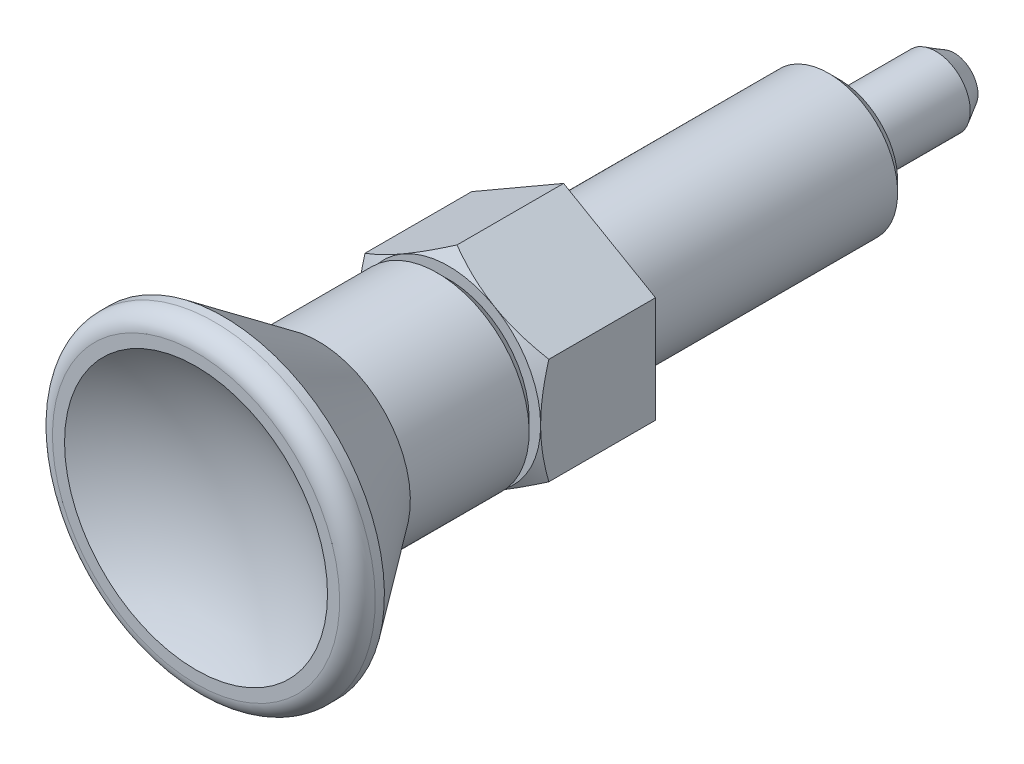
ISO-10303-21;
HEADER;
FILE_DESCRIPTION(('STEP AP214'),'2;1');
FILE_NAME('part.step','',(''),(''),'','','');
FILE_SCHEMA(('AUTOMOTIVE_DESIGN { 1 0 10303 214 1 1 1 1 }'));
ENDSEC;
DATA;
#1=APPLICATION_CONTEXT('core data for automotive mechanical design processes');
#2=APPLICATION_PROTOCOL_DEFINITION('international standard','automotive_design',2000,#1);
#3=PRODUCT_CONTEXT('',#1,'mechanical');
#4=PRODUCT('Part','Part','',(#3));
#5=PRODUCT_RELATED_PRODUCT_CATEGORY('part','',(#4));
#6=PRODUCT_DEFINITION_FORMATION('','',#4);
#7=PRODUCT_DEFINITION_CONTEXT('part definition',#1,'design');
#8=PRODUCT_DEFINITION('design','',#6,#7);
#9=PRODUCT_DEFINITION_SHAPE('','',#8);
#10=(LENGTH_UNIT() NAMED_UNIT(*) SI_UNIT(.MILLI.,.METRE.));
#11=(NAMED_UNIT(*) PLANE_ANGLE_UNIT() SI_UNIT($,.RADIAN.));
#12=(NAMED_UNIT(*) SI_UNIT($,.STERADIAN.) SOLID_ANGLE_UNIT());
#13=UNCERTAINTY_MEASURE_WITH_UNIT(LENGTH_MEASURE(1.E-05),#10,'distance_accuracy_value','');
#14=(GEOMETRIC_REPRESENTATION_CONTEXT(3) GLOBAL_UNCERTAINTY_ASSIGNED_CONTEXT((#13)) GLOBAL_UNIT_ASSIGNED_CONTEXT((#10,
#11,#12)) REPRESENTATION_CONTEXT('',''));
#15=CARTESIAN_POINT('',(0.,0.,0.));
#16=DIRECTION('',(0.,0.,1.));
#17=DIRECTION('',(1.,0.,0.));
#18=AXIS2_PLACEMENT_3D('',#15,#16,#17);
#19=CARTESIAN_POINT('',(0.,0.,3.2679491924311));
#20=DIRECTION('',(0.,0.,-1.));
#21=DIRECTION('',(1.,0.,0.));
#22=AXIS2_PLACEMENT_3D('',#19,#20,#21);
#23=CONICAL_SURFACE('',#22,7.,1.0471975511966);
#24=CARTESIAN_POINT('',(-4.,6.31761832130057,2.9922916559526));
#25=CARTESIAN_POINT('',(-4.,6.14192520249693,3.07797180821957));
#26=CARTESIAN_POINT('',(-4.,5.96584084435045,3.16286285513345));
#27=CARTESIAN_POINT('',(-4.,5.61268201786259,3.33062511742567));
#28=CARTESIAN_POINT('',(-4.,5.4356074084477,3.4134960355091));
#29=CARTESIAN_POINT('',(-4.,5.07940162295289,3.57716927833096));
#30=CARTESIAN_POINT('',(-4.,4.9002645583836,3.65795883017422));
#31=CARTESIAN_POINT('',(-4.,4.54060511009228,3.81638112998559));
#32=CARTESIAN_POINT('',(-4.,4.36008278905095,3.89401401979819));
#33=CARTESIAN_POINT('',(-4.,3.9911078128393,4.04790350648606));
#34=CARTESIAN_POINT('',(-4.,3.80259647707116,4.12402014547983));
#35=CARTESIAN_POINT('',(-4.,3.42341084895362,4.27076449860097));
#36=CARTESIAN_POINT('',(-4.,3.23273632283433,4.34139161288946));
#37=CARTESIAN_POINT('',(-4.,2.84924251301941,4.47538599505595));
#38=CARTESIAN_POINT('',(-4.,2.65642808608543,4.5387670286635));
#39=CARTESIAN_POINT('',(-4.,2.2680353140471,4.65631131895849));
#40=CARTESIAN_POINT('',(-4.,2.07245782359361,4.71047736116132));
#41=CARTESIAN_POINT('',(-4.,1.67954158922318,4.80677280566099));
#42=CARTESIAN_POINT('',(-4.,1.48222021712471,4.84897182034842));
#43=CARTESIAN_POINT('',(-4.,1.08500777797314,4.91903453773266));
#44=CARTESIAN_POINT('',(-4.,0.885116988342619,4.94689977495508));
#45=CARTESIAN_POINT('',(-4.,0.48641972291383,4.98571330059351));
#46=CARTESIAN_POINT('',(-4.,0.287635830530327,4.9968878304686));
#47=CARTESIAN_POINT('',(-4.,-0.110173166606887,5.00197590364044));
#48=CARTESIAN_POINT('',(-4.,-0.309198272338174,4.99588937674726));
#49=CARTESIAN_POINT('',(-4.,-0.643785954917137,4.97158820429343));
#50=CARTESIAN_POINT('',(-4.,-0.779690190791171,4.95777215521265));
#51=CARTESIAN_POINT('',(-4.,-1.05057142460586,4.92289191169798));
#52=CARTESIAN_POINT('',(-4.,-1.18554830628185,4.9018268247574));
#53=CARTESIAN_POINT('',(-4.,-1.58887088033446,4.8288581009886));
#54=CARTESIAN_POINT('',(-4.,-1.8554737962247,4.76719214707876));
#55=CARTESIAN_POINT('',(-4.,-2.2542740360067,4.65940087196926));
#56=CARTESIAN_POINT('',(-4.,-2.38851478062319,4.62039718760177));
#57=CARTESIAN_POINT('',(-4.,-2.65569482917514,4.53812259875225));
#58=CARTESIAN_POINT('',(-4.,-2.78863412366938,4.49485166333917));
#59=CARTESIAN_POINT('',(-4.,-3.05324930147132,4.40475468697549));
#60=CARTESIAN_POINT('',(-4.,-3.18492553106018,4.3579296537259));
#61=CARTESIAN_POINT('',(-4.,-3.44717271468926,4.26129676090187));
#62=CARTESIAN_POINT('',(-4.,-3.57774368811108,4.21148895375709));
#63=CARTESIAN_POINT('',(-4.,-3.90838583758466,4.08171887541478));
#64=CARTESIAN_POINT('',(-4.,-4.10778247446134,4.00004019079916));
#65=CARTESIAN_POINT('',(-4.,-4.50466534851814,3.83215118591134));
#66=CARTESIAN_POINT('',(-4.,-4.70215141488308,3.74594046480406));
#67=CARTESIAN_POINT('',(-4.,-5.09560571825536,3.56998451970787));
#68=CARTESIAN_POINT('',(-4.,-5.29157350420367,3.48023829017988));
#69=CARTESIAN_POINT('',(-4.,-5.68222178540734,3.29798176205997));
#70=CARTESIAN_POINT('',(-4.,-5.87690224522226,3.2054713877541));
#71=CARTESIAN_POINT('',(-4.,-6.45989965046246,2.92441834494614));
#72=CARTESIAN_POINT('',(-4.,-6.84663497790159,2.73259823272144));
#73=CARTESIAN_POINT('',(-4.,-7.61714397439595,2.34330251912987));
#74=CARTESIAN_POINT('',(-4.,-8.0009181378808,2.14582788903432));
#75=CARTESIAN_POINT('',(-4.,-8.72975807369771,1.76604091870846));
#76=CARTESIAN_POINT('',(-4.,-9.07501124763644,1.58408754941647));
#77=CARTESIAN_POINT('',(-4.,-9.76427122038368,1.21779786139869));
#78=CARTESIAN_POINT('',(-4.,-10.1082779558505,1.03346142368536));
#79=CARTESIAN_POINT('',(-4.,-10.7942722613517,0.663568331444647));
#80=CARTESIAN_POINT('',(-4.,-11.1362627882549,0.478017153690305));
#81=CARTESIAN_POINT('',(-4.,-11.8194584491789,0.105530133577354));
#82=CARTESIAN_POINT('',(-4.,-12.1606636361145,-0.0814056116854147));
#83=CARTESIAN_POINT('',(-4.,-12.5015869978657,-0.26885020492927));
#84=B_SPLINE_CURVE_WITH_KNOTS('',3,(#24,#25,#26,#27,#28,#29,#30,#31,#32,#33,#34,#35,#36,#37,#38,
#39,#40,#41,#42,#43,#44,#45,#46,#47,#48,#49,#50,#51,#52,#53,#54,#55,#56,#57,#58,#59,#60,#61,#62,
#63,#64,#65,#66,#67,#68,#69,#70,#71,#72,#73,#74,#75,#76,#77,#78,#79,#80,#81,#82,#83),
.UNSPECIFIED.,.F.,.F.,(4,2,2,2,2,2,2,2,2,2,2,2,2,2,2,2,2,2,2,2,2,2,2,2,2,2,2,2,2,4),(0.,
0.586421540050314,1.1729288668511,1.76244097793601,2.35192656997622,2.96175582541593,
3.5716516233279,4.18036881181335,4.78890166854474,5.39381845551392,5.99867046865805,
6.59524689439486,7.1918257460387,7.60144321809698,8.01111114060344,8.83085062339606,
9.25018861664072,9.66952964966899,10.0887522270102,10.5079674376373,11.1543192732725,
11.8007283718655,12.447322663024,13.0939346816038,14.3889300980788,15.6837043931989,
16.8544868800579,18.0253280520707,19.1925780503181,20.3597469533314),.UNSPECIFIED.);
#85=CARTESIAN_POINT('',(-4.,-2.3094010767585,4.64273441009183));
#86=VERTEX_POINT('',#85);
#87=CARTESIAN_POINT('',(-4.,0.,5.));
#88=VERTEX_POINT('',#87);
#89=EDGE_CURVE('E9',#86,#88,#84,.F.);
#90=ORIENTED_EDGE('',*,*,#89,.F.);
#91=CARTESIAN_POINT('',(0.000199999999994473,-4.61891762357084,4.64266774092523));
#92=CARTESIAN_POINT('',(-0.175579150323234,-4.5174314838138,4.70128212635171));
#93=CARTESIAN_POINT('',(-0.352875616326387,-4.41506932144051,4.75458967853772));
#94=CARTESIAN_POINT('',(-0.710538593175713,-4.20857250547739,4.84763832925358));
#95=CARTESIAN_POINT('',(-0.890911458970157,-4.10443418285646,4.88734651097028));
#96=CARTESIAN_POINT('',(-1.2494218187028,-3.89744813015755,4.94915778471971));
#97=CARTESIAN_POINT('',(-1.42750415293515,-3.79463224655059,4.97167226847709));
#98=CARTESIAN_POINT('',(-1.78450671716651,-3.58851671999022,4.99854937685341));
#99=CARTESIAN_POINT('',(-1.96342564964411,-3.48521782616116,5.00293425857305));
#100=CARTESIAN_POINT('',(-2.29774284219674,-3.29219970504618,4.99380992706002));
#101=CARTESIAN_POINT('',(-2.45319115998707,-3.20245157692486,4.98254104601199));
#102=CARTESIAN_POINT('',(-2.76307505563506,-3.02354002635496,4.94682600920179));
#103=CARTESIAN_POINT('',(-2.91750956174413,-2.93437722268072,4.92236765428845));
#104=CARTESIAN_POINT('',(-3.22803232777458,-2.75509682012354,4.86122393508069));
#105=CARTESIAN_POINT('',(-3.3840812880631,-2.66500191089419,4.82427939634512));
#106=CARTESIAN_POINT('',(-3.69385183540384,-2.486155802,4.74042992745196));
#107=CARTESIAN_POINT('',(-3.84757739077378,-2.39740231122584,4.69354469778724));
#108=CARTESIAN_POINT('',(-4.0002,-2.30928560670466,4.64266774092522));
#109=B_SPLINE_CURVE_WITH_KNOTS('',3,(#91,#92,#93,#94,#95,#96,#97,#98,#99,#100,#101,#102,#103,
#104,#105,#106,#107,#108),.UNSPECIFIED.,.F.,.F.,(4,2,2,2,2,2,2,2,4),(0.,0.634047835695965,
1.26961969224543,1.88946157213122,2.50854226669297,3.04757825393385,3.58711366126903,
4.13861653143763,4.68903648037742),.UNSPECIFIED.);
#110=CARTESIAN_POINT('',(-2.,-3.46410161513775,5.));
#111=VERTEX_POINT('',#110);
#112=EDGE_CURVE('E203',#111,#86,#109,.T.);
#113=ORIENTED_EDGE('',*,*,#112,.F.);
#114=CARTESIAN_POINT('',(0.,0.,5.));
#115=DIRECTION('',(0.,0.,1.));
#116=DIRECTION('',(-1.,0.,0.));
#117=AXIS2_PLACEMENT_3D('',#114,#115,#116);
#118=CIRCLE('',#117,4.);
#119=EDGE_CURVE('E124',#88,#111,#118,.T.);
#120=ORIENTED_EDGE('',*,*,#119,.F.);
#121=EDGE_LOOP('',(#90,#113,#120));
#122=FACE_BOUND('',#121,.T.);
#123=ADVANCED_FACE('F14',(#122),#23,.T.);
#124=CARTESIAN_POINT('',(-4.,2.3094010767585,4.64273441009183));
#125=VERTEX_POINT('',#124);
#126=EDGE_CURVE('E18',#88,#125,#84,.F.);
#127=ORIENTED_EDGE('',*,*,#126,.F.);
#128=CARTESIAN_POINT('',(-2.,3.46410161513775,5.));
#129=VERTEX_POINT('',#128);
#130=EDGE_CURVE('E116',#129,#88,#118,.T.);
#131=ORIENTED_EDGE('',*,*,#130,.F.);
#132=CARTESIAN_POINT('',(-4.0002,2.30928560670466,4.64266774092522));
#133=CARTESIAN_POINT('',(-3.82442084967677,2.4107717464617,4.7012821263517));
#134=CARTESIAN_POINT('',(-3.64712438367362,2.51313390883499,4.75458967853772));
#135=CARTESIAN_POINT('',(-3.28946140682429,2.71963072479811,4.84763832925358));
#136=CARTESIAN_POINT('',(-3.10908854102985,2.82376904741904,4.88734651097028));
#137=CARTESIAN_POINT('',(-2.75057818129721,3.03075510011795,4.9491577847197));
#138=CARTESIAN_POINT('',(-2.57249584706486,3.13357098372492,4.97167226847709));
#139=CARTESIAN_POINT('',(-2.21549328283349,3.33968651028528,4.99854937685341));
#140=CARTESIAN_POINT('',(-2.0365743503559,3.44298540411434,5.00293425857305));
#141=CARTESIAN_POINT('',(-1.70225715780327,3.63600352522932,4.99380992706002));
#142=CARTESIAN_POINT('',(-1.54680884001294,3.72575165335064,4.98254104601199));
#143=CARTESIAN_POINT('',(-1.23692494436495,3.90466320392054,4.94682600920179));
#144=CARTESIAN_POINT('',(-1.08249043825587,3.99382600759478,4.92236765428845));
#145=CARTESIAN_POINT('',(-0.771967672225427,4.17310641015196,4.8612239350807));
#146=CARTESIAN_POINT('',(-0.615918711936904,4.2632013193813,4.82427939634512));
#147=CARTESIAN_POINT('',(-0.306148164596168,4.4420474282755,4.74042992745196));
#148=CARTESIAN_POINT('',(-0.152422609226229,4.53080091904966,4.69354469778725));
#149=CARTESIAN_POINT('',(0.00019999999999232,4.61891762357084,4.64266774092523));
#150=B_SPLINE_CURVE_WITH_KNOTS('',3,(#132,#133,#134,#135,#136,#137,#138,#139,#140,#141,#142,
#143,#144,#145,#146,#147,#148,#149),.UNSPECIFIED.,.F.,.F.,(4,2,2,2,2,2,2,2,4),(0.,
0.634047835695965,1.26961969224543,1.88946157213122,2.50854226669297,3.04757825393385,
3.58711366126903,4.13861653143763,4.68903648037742),.UNSPECIFIED.);
#151=EDGE_CURVE('E262',#125,#129,#150,.T.);
#152=ORIENTED_EDGE('',*,*,#151,.F.);
#153=EDGE_LOOP('',(#127,#131,#152));
#154=FACE_BOUND('',#153,.T.);
#155=ADVANCED_FACE('F225',(#154),#23,.T.);
#156=CARTESIAN_POINT('',(0.,4.618802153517,4.64273441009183));
#157=VERTEX_POINT('',#156);
#158=EDGE_CURVE('E112',#129,#157,#150,.T.);
#159=ORIENTED_EDGE('',*,*,#158,.F.);
#160=CARTESIAN_POINT('',(2.,3.46410161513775,5.));
#161=VERTEX_POINT('',#160);
#162=EDGE_CURVE('E110',#161,#129,#118,.T.);
#163=ORIENTED_EDGE('',*,*,#162,.F.);
#164=CARTESIAN_POINT('',(-0.000200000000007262,4.61891762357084,4.64266774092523));
#165=CARTESIAN_POINT('',(0.175579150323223,4.5174314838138,4.7012821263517));
#166=CARTESIAN_POINT('',(0.352875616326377,4.41506932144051,4.75458967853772));
#167=CARTESIAN_POINT('',(0.710538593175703,4.20857250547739,4.84763832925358));
#168=CARTESIAN_POINT('',(0.890911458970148,4.10443418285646,4.88734651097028));
#169=CARTESIAN_POINT('',(1.24942181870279,3.89744813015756,4.9491577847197));
#170=CARTESIAN_POINT('',(1.42750415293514,3.79463224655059,4.97167226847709));
#171=CARTESIAN_POINT('',(1.78450671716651,3.58851671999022,4.99854937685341));
#172=CARTESIAN_POINT('',(1.9634256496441,3.48521782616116,5.00293425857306));
#173=CARTESIAN_POINT('',(2.29774284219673,3.29219970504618,4.99380992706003));
#174=CARTESIAN_POINT('',(2.45319115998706,3.20245157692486,4.982541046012));
#175=CARTESIAN_POINT('',(2.76307505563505,3.02354002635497,4.94682600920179));
#176=CARTESIAN_POINT('',(2.91750956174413,2.93437722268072,4.92236765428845));
#177=CARTESIAN_POINT('',(3.22803232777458,2.75509682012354,4.8612239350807));
#178=CARTESIAN_POINT('',(3.3840812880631,2.6650019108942,4.82427939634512));
#179=CARTESIAN_POINT('',(3.69385183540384,2.486155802,4.74042992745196));
#180=CARTESIAN_POINT('',(3.84757739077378,2.39740231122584,4.69354469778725));
#181=CARTESIAN_POINT('',(4.0002,2.30928560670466,4.64266774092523));
#182=B_SPLINE_CURVE_WITH_KNOTS('',3,(#164,#165,#166,#167,#168,#169,#170,#171,#172,#173,#174,
#175,#176,#177,#178,#179,#180,#181),.UNSPECIFIED.,.F.,.F.,(4,2,2,2,2,2,2,2,4),(0.,
0.634047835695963,1.26961969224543,1.88946157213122,2.50854226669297,3.04757825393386,
3.58711366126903,4.13861653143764,4.68903648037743),.UNSPECIFIED.);
#183=EDGE_CURVE('E90',#157,#161,#182,.T.);
#184=ORIENTED_EDGE('',*,*,#183,.F.);
#185=EDGE_LOOP('',(#159,#163,#184));
#186=FACE_BOUND('',#185,.T.);
#187=ADVANCED_FACE('F111',(#186),#23,.T.);
#188=CARTESIAN_POINT('',(0.,-4.618802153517,4.64273441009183));
#189=VERTEX_POINT('',#188);
#190=EDGE_CURVE('E198',#189,#111,#109,.T.);
#191=ORIENTED_EDGE('',*,*,#190,.F.);
#192=CARTESIAN_POINT('',(4.0002,-2.30928560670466,4.64266774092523));
#193=CARTESIAN_POINT('',(3.82442084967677,-2.4107717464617,4.70128212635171));
#194=CARTESIAN_POINT('',(3.64712438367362,-2.51313390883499,4.75458967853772));
#195=CARTESIAN_POINT('',(3.28946140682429,-2.71963072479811,4.84763832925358));
#196=CARTESIAN_POINT('',(3.10908854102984,-2.82376904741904,4.88734651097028));
#197=CARTESIAN_POINT('',(2.75057818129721,-3.03075510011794,4.94915778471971));
#198=CARTESIAN_POINT('',(2.57249584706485,-3.13357098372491,4.97167226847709));
#199=CARTESIAN_POINT('',(2.21549328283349,-3.33968651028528,4.99854937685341));
#200=CARTESIAN_POINT('',(2.03657435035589,-3.44298540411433,5.00293425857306));
#201=CARTESIAN_POINT('',(1.70225715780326,-3.63600352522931,4.99380992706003));
#202=CARTESIAN_POINT('',(1.54680884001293,-3.72575165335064,4.982541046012));
#203=CARTESIAN_POINT('',(1.23692494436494,-3.90466320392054,4.94682600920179));
#204=CARTESIAN_POINT('',(1.08249043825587,-3.99382600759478,4.92236765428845));
#205=CARTESIAN_POINT('',(0.771967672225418,-4.17310641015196,4.8612239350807));
#206=CARTESIAN_POINT('',(0.615918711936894,-4.2632013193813,4.82427939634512));
#207=CARTESIAN_POINT('',(0.306148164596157,-4.4420474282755,4.74042992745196));
#208=CARTESIAN_POINT('',(0.152422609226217,-4.53080091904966,4.69354469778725));
#209=CARTESIAN_POINT('',(-0.000200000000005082,-4.61891762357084,4.64266774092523));
#210=B_SPLINE_CURVE_WITH_KNOTS('',3,(#192,#193,#194,#195,#196,#197,#198,#199,#200,#201,#202,
#203,#204,#205,#206,#207,#208,#209),.UNSPECIFIED.,.F.,.F.,(4,2,2,2,2,2,2,2,4),(0.,
0.634047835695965,1.26961969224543,1.88946157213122,2.50854226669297,3.04757825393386,
3.58711366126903,4.13861653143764,4.68903648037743),.UNSPECIFIED.);
#211=CARTESIAN_POINT('',(2.,-3.46410161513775,5.));
#212=VERTEX_POINT('',#211);
#213=EDGE_CURVE('E100',#212,#189,#210,.T.);
#214=ORIENTED_EDGE('',*,*,#213,.F.);
#215=EDGE_CURVE('E123',#111,#212,#118,.T.);
#216=ORIENTED_EDGE('',*,*,#215,.F.);
#217=EDGE_LOOP('',(#191,#214,#216));
#218=FACE_BOUND('',#217,.T.);
#219=ADVANCED_FACE('F243',(#218),#23,.T.);
#220=CARTESIAN_POINT('',(4.,2.3094010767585,4.64273441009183));
#221=VERTEX_POINT('',#220);
#222=EDGE_CURVE('E94',#161,#221,#182,.T.);
#223=ORIENTED_EDGE('',*,*,#222,.F.);
#224=CARTESIAN_POINT('',(4.,0.,5.));
#225=VERTEX_POINT('',#224);
#226=EDGE_CURVE('E106',#225,#161,#118,.T.);
#227=ORIENTED_EDGE('',*,*,#226,.F.);
#228=CARTESIAN_POINT('',(4.,6.31761832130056,2.9922916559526));
#229=CARTESIAN_POINT('',(4.,6.14192520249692,3.07797180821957));
#230=CARTESIAN_POINT('',(4.,5.96584084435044,3.16286285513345));
#231=CARTESIAN_POINT('',(4.,5.61268201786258,3.33062511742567));
#232=CARTESIAN_POINT('',(4.,5.4356074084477,3.4134960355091));
#233=CARTESIAN_POINT('',(4.,5.07940162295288,3.57716927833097));
#234=CARTESIAN_POINT('',(4.,4.9002645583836,3.65795883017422));
#235=CARTESIAN_POINT('',(4.,4.54060511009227,3.81638112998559));
#236=CARTESIAN_POINT('',(4.,4.36008278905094,3.89401401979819));
#237=CARTESIAN_POINT('',(4.,3.99110781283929,4.04790350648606));
#238=CARTESIAN_POINT('',(4.,3.80259647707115,4.12402014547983));
#239=CARTESIAN_POINT('',(4.,3.42341084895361,4.27076449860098));
#240=CARTESIAN_POINT('',(4.,3.23273632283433,4.34139161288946));
#241=CARTESIAN_POINT('',(4.,2.84924251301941,4.47538599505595));
#242=CARTESIAN_POINT('',(4.,2.65642808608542,4.5387670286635));
#243=CARTESIAN_POINT('',(4.,2.2680353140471,4.65631131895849));
#244=CARTESIAN_POINT('',(4.,2.07245782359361,4.71047736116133));
#245=CARTESIAN_POINT('',(4.,1.67954158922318,4.806772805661));
#246=CARTESIAN_POINT('',(4.,1.48222021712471,4.84897182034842));
#247=CARTESIAN_POINT('',(4.,1.08500777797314,4.91903453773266));
#248=CARTESIAN_POINT('',(4.,0.885116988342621,4.94689977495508));
#249=CARTESIAN_POINT('',(4.,0.486419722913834,4.98571330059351));
#250=CARTESIAN_POINT('',(4.,0.287635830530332,4.9968878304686));
#251=CARTESIAN_POINT('',(4.,-0.110173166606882,5.00197590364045));
#252=CARTESIAN_POINT('',(4.,-0.309198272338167,4.99588937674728));
#253=CARTESIAN_POINT('',(4.,-0.643785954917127,4.97158820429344));
#254=CARTESIAN_POINT('',(4.,-0.779690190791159,4.95777215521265));
#255=CARTESIAN_POINT('',(4.,-1.05057142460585,4.92289191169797));
#256=CARTESIAN_POINT('',(4.,-1.18554830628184,4.9018268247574));
#257=CARTESIAN_POINT('',(4.,-1.58887088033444,4.8288581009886));
#258=CARTESIAN_POINT('',(4.,-1.85547379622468,4.76719214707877));
#259=CARTESIAN_POINT('',(4.,-2.25427403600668,4.65940087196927));
#260=CARTESIAN_POINT('',(4.,-2.38851478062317,4.62039718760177));
#261=CARTESIAN_POINT('',(4.,-2.65569482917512,4.53812259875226));
#262=CARTESIAN_POINT('',(4.,-2.78863412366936,4.49485166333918));
#263=CARTESIAN_POINT('',(4.,-3.0532493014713,4.4047546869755));
#264=CARTESIAN_POINT('',(4.,-3.18492553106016,4.3579296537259));
#265=CARTESIAN_POINT('',(4.,-3.44717271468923,4.26129676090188));
#266=CARTESIAN_POINT('',(4.,-3.57774368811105,4.2114889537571));
#267=CARTESIAN_POINT('',(4.,-3.90838583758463,4.0817188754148));
#268=CARTESIAN_POINT('',(4.,-4.10778247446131,4.00004019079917));
#269=CARTESIAN_POINT('',(4.,-4.50466534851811,3.83215118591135));
#270=CARTESIAN_POINT('',(4.,-4.70215141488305,3.74594046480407));
#271=CARTESIAN_POINT('',(4.,-5.09560571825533,3.56998451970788));
#272=CARTESIAN_POINT('',(4.,-5.29157350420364,3.48023829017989));
#273=CARTESIAN_POINT('',(4.,-5.68222178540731,3.29798176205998));
#274=CARTESIAN_POINT('',(4.,-5.87690224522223,3.20547138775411));
#275=CARTESIAN_POINT('',(4.,-6.45989965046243,2.92441834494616));
#276=CARTESIAN_POINT('',(4.,-6.84663497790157,2.73259823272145));
#277=CARTESIAN_POINT('',(4.,-7.61714397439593,2.34330251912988));
#278=CARTESIAN_POINT('',(4.,-8.00091813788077,2.14582788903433));
#279=CARTESIAN_POINT('',(4.,-8.72975807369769,1.76604091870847));
#280=CARTESIAN_POINT('',(4.,-9.07501124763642,1.58408754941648));
#281=CARTESIAN_POINT('',(4.,-9.76427122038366,1.2177978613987));
#282=CARTESIAN_POINT('',(4.,-10.1082779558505,1.03346142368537));
#283=CARTESIAN_POINT('',(4.,-10.7942722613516,0.663568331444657));
#284=CARTESIAN_POINT('',(4.,-11.1362627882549,0.478017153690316));
#285=CARTESIAN_POINT('',(4.,-11.8194584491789,0.105530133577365));
#286=CARTESIAN_POINT('',(4.,-12.1606636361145,-0.0814056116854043));
#287=CARTESIAN_POINT('',(4.,-12.5015869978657,-0.268850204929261));
#288=B_SPLINE_CURVE_WITH_KNOTS('',3,(#228,#229,#230,#231,#232,#233,#234,#235,#236,#237,#238,
#239,#240,#241,#242,#243,#244,#245,#246,#247,#248,#249,#250,#251,#252,#253,#254,#255,#256,#257,
#258,#259,#260,#261,#262,#263,#264,#265,#266,#267,#268,#269,#270,#271,#272,#273,#274,#275,#276,
#277,#278,#279,#280,#281,#282,#283,#284,#285,#286,#287),.UNSPECIFIED.,.F.,.F.,(4,2,2,2,2,2,2,2,
2,2,2,2,2,2,2,2,2,2,2,2,2,2,2,2,2,2,2,2,2,4),(0.,0.586421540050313,1.1729288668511,
1.762440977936,2.35192656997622,2.96175582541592,3.57165162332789,4.18036881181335,
4.78890166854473,5.39381845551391,5.99867046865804,6.59524689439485,7.19182574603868,
7.60144321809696,8.01111114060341,8.83085062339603,9.25018861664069,9.66952964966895,
10.0887522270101,10.5079674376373,11.1543192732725,11.8007283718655,12.4473226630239,
13.0939346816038,14.3889300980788,15.6837043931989,16.8544868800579,18.0253280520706,
19.1925780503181,20.3597469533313),.UNSPECIFIED.);
#289=EDGE_CURVE('E41',#221,#225,#288,.T.);
#290=ORIENTED_EDGE('',*,*,#289,.F.);
#291=EDGE_LOOP('',(#223,#227,#290));
#292=FACE_BOUND('',#291,.T.);
#293=ADVANCED_FACE('F104',(#292),#23,.T.);
#294=CARTESIAN_POINT('',(4.,-2.3094010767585,4.64273441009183));
#295=VERTEX_POINT('',#294);
#296=EDGE_CURVE('E108',#295,#212,#210,.T.);
#297=ORIENTED_EDGE('',*,*,#296,.F.);
#298=EDGE_CURVE('E168',#225,#295,#288,.T.);
#299=ORIENTED_EDGE('',*,*,#298,.F.);
#300=EDGE_CURVE('E122',#212,#225,#118,.T.);
#301=ORIENTED_EDGE('',*,*,#300,.F.);
#302=EDGE_LOOP('',(#297,#299,#301));
#303=FACE_BOUND('',#302,.T.);
#304=ADVANCED_FACE('F227',(#303),#23,.T.);
#305=CARTESIAN_POINT('',(2.35599040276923E-13,0.,24.1999999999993));
#306=DIRECTION('',(0.,0.,1.));
#307=DIRECTION('',(-1.,0.,0.));
#308=AXIS2_PLACEMENT_3D('',#305,#306,#307);
#309=SPHERICAL_SURFACE('',#308,9.99999999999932);
#310=CARTESIAN_POINT('',(0.,0.,16.));
#311=DIRECTION('',(0.,0.,1.));
#312=DIRECTION('',(0.,-1.,0.));
#313=AXIS2_PLACEMENT_3D('',#310,#311,#312);
#314=CIRCLE('',#313,5.7236352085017);
#315=CARTESIAN_POINT('',(0.,-5.7236352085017,16.));
#316=VERTEX_POINT('',#315);
#317=EDGE_CURVE('E165',#316,#316,#314,.T.);
#318=ORIENTED_EDGE('',*,*,#317,.T.);
#319=EDGE_LOOP('',(#318));
#320=FACE_BOUND('',#319,.T.);
#321=ADVANCED_FACE('F16',(#320),#309,.F.);
#322=CARTESIAN_POINT('',(5.7236352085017,0.,16.));
#323=DIRECTION('',(0.,0.,1.));
#324=DIRECTION('',(0.,-1.,0.));
#325=AXIS2_PLACEMENT_3D('',#322,#323,#324);
#326=PLANE('',#325);
#327=CARTESIAN_POINT('',(0.,0.,16.));
#328=DIRECTION('',(0.,0.,1.));
#329=DIRECTION('',(0.,-1.,0.));
#330=AXIS2_PLACEMENT_3D('',#327,#328,#329);
#331=CIRCLE('',#330,6.25);
#332=CARTESIAN_POINT('',(0.,-6.25,16.));
#333=VERTEX_POINT('',#332);
#334=EDGE_CURVE('E162',#333,#333,#331,.T.);
#335=ORIENTED_EDGE('',*,*,#334,.T.);
#336=EDGE_LOOP('',(#335));
#337=FACE_BOUND('',#336,.T.);
#338=ORIENTED_EDGE('',*,*,#317,.F.);
#339=EDGE_LOOP('',(#338));
#340=FACE_BOUND('',#339,.T.);
#341=ADVANCED_FACE('F241',(#337,#340),#326,.T.);
#342=CARTESIAN_POINT('',(0.,0.,15.2015639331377));
#343=DIRECTION('',(0.,0.,1.));
#344=DIRECTION('',(0.,-1.,0.));
#345=AXIS2_PLACEMENT_3D('',#342,#343,#344);
#346=TOROIDAL_SURFACE('',#345,6.20000152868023,0.800000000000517);
#347=CARTESIAN_POINT('',(0.,0.,15.2));
#348=DIRECTION('',(0.,0.,1.));
#349=DIRECTION('',(0.,-1.,0.));
#350=AXIS2_PLACEMENT_3D('',#347,#348,#349);
#351=CIRCLE('',#350,7.);
#352=CARTESIAN_POINT('',(0.,-7.,15.2));
#353=VERTEX_POINT('',#352);
#354=EDGE_CURVE('E159',#353,#353,#351,.T.);
#355=ORIENTED_EDGE('',*,*,#354,.T.);
#356=EDGE_LOOP('',(#355));
#357=FACE_BOUND('',#356,.T.);
#358=ORIENTED_EDGE('',*,*,#334,.F.);
#359=EDGE_LOOP('',(#358));
#360=FACE_BOUND('',#359,.T.);
#361=ADVANCED_FACE('F335',(#357,#360),#346,.T.);
#362=CARTESIAN_POINT('',(0.,0.,-17.));
#363=DIRECTION('',(0.,0.,1.));
#364=DIRECTION('',(0.,-1.,0.));
#365=AXIS2_PLACEMENT_3D('',#362,#363,#364);
#366=CYLINDRICAL_SURFACE('',#365,7.);
#367=CARTESIAN_POINT('',(0.,0.,14.8));
#368=DIRECTION('',(0.,0.,1.));
#369=DIRECTION('',(0.,-1.,0.));
#370=AXIS2_PLACEMENT_3D('',#367,#368,#369);
#371=CIRCLE('',#370,7.);
#372=CARTESIAN_POINT('',(0.,-7.,14.8));
#373=VERTEX_POINT('',#372);
#374=EDGE_CURVE('E156',#373,#373,#371,.T.);
#375=ORIENTED_EDGE('',*,*,#374,.T.);
#376=EDGE_LOOP('',(#375));
#377=FACE_BOUND('',#376,.T.);
#378=ORIENTED_EDGE('',*,*,#354,.F.);
#379=EDGE_LOOP('',(#378));
#380=FACE_BOUND('',#379,.T.);
#381=ADVANCED_FACE('F331',(#377,#380),#366,.T.);
#382=CARTESIAN_POINT('',(0.,0.,14.8));
#383=DIRECTION('',(0.,0.,1.));
#384=DIRECTION('',(0.,-1.,0.));
#385=AXIS2_PLACEMENT_3D('',#382,#383,#384);
#386=CONICAL_SURFACE('',#385,7.,0.628318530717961);
#387=CARTESIAN_POINT('',(0.,0.,10.6708542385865));
#388=DIRECTION('',(0.,0.,1.));
#389=DIRECTION('',(0.,-1.,0.));
#390=AXIS2_PLACEMENT_3D('',#387,#388,#389);
#391=CIRCLE('',#390,4.);
#392=CARTESIAN_POINT('',(0.,-4.,10.6708542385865));
#393=VERTEX_POINT('',#392);
#394=EDGE_CURVE('E153',#393,#393,#391,.T.);
#395=ORIENTED_EDGE('',*,*,#394,.T.);
#396=EDGE_LOOP('',(#395));
#397=FACE_BOUND('',#396,.T.);
#398=ORIENTED_EDGE('',*,*,#374,.F.);
#399=EDGE_LOOP('',(#398));
#400=FACE_BOUND('',#399,.T.);
#401=ADVANCED_FACE('F327',(#397,#400),#386,.T.);
#402=CARTESIAN_POINT('',(0.,0.,-17.));
#403=DIRECTION('',(0.,0.,1.));
#404=DIRECTION('',(0.,-1.,0.));
#405=AXIS2_PLACEMENT_3D('',#402,#403,#404);
#406=CYLINDRICAL_SURFACE('',#405,4.);
#407=CARTESIAN_POINT('',(0.,0.,5.5));
#408=DIRECTION('',(0.,0.,1.));
#409=DIRECTION('',(0.,-1.,0.));
#410=AXIS2_PLACEMENT_3D('',#407,#408,#409);
#411=CIRCLE('',#410,4.);
#412=CARTESIAN_POINT('',(0.,-4.,5.5));
#413=VERTEX_POINT('',#412);
#414=EDGE_CURVE('E150',#413,#413,#411,.T.);
#415=ORIENTED_EDGE('',*,*,#414,.T.);
#416=EDGE_LOOP('',(#415));
#417=FACE_BOUND('',#416,.T.);
#418=ORIENTED_EDGE('',*,*,#394,.F.);
#419=EDGE_LOOP('',(#418));
#420=FACE_BOUND('',#419,.T.);
#421=ADVANCED_FACE('F323',(#417,#420),#406,.T.);
#422=CARTESIAN_POINT('',(0.,0.,5.5));
#423=DIRECTION('',(0.,0.,1.));
#424=DIRECTION('',(0.,-1.,0.));
#425=AXIS2_PLACEMENT_3D('',#422,#423,#424);
#426=CONICAL_SURFACE('',#425,4.,0.785398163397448);
#427=CARTESIAN_POINT('',(0.,0.,5.));
#428=DIRECTION('',(0.,0.,1.));
#429=DIRECTION('',(0.,-1.,0.));
#430=AXIS2_PLACEMENT_3D('',#427,#428,#429);
#431=CIRCLE('',#430,3.5);
#432=CARTESIAN_POINT('',(0.,-3.5,5.));
#433=VERTEX_POINT('',#432);
#434=EDGE_CURVE('E147',#433,#433,#431,.T.);
#435=ORIENTED_EDGE('',*,*,#434,.T.);
#436=EDGE_LOOP('',(#435));
#437=FACE_BOUND('',#436,.T.);
#438=ORIENTED_EDGE('',*,*,#414,.F.);
#439=EDGE_LOOP('',(#438));
#440=FACE_BOUND('',#439,.T.);
#441=ADVANCED_FACE('F312',(#437,#440),#426,.T.);
#442=CARTESIAN_POINT('',(4.,0.,5.));
#443=DIRECTION('',(0.,0.,-1.));
#444=DIRECTION('',(1.,0.,0.));
#445=AXIS2_PLACEMENT_3D('',#442,#443,#444);
#446=PLANE('',#445);
#447=ORIENTED_EDGE('',*,*,#434,.F.);
#448=EDGE_LOOP('',(#447));
#449=FACE_BOUND('',#448,.T.);
#450=ORIENTED_EDGE('',*,*,#119,.T.);
#451=ORIENTED_EDGE('',*,*,#215,.T.);
#452=ORIENTED_EDGE('',*,*,#300,.T.);
#453=ORIENTED_EDGE('',*,*,#226,.T.);
#454=ORIENTED_EDGE('',*,*,#162,.T.);
#455=ORIENTED_EDGE('',*,*,#130,.T.);
#456=EDGE_LOOP('',(#450,#451,#452,#453,#454,#455));
#457=FACE_BOUND('',#456,.T.);
#458=ADVANCED_FACE('F119',(#449,#457),#446,.F.);
#459=CARTESIAN_POINT('',(4.,2.3094010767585,-2.));
#460=DIRECTION('',(0.5,0.866025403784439,0.));
#461=DIRECTION('',(-0.866025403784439,0.5,0.));
#462=AXIS2_PLACEMENT_3D('',#459,#460,#461);
#463=PLANE('',#462);
#464=DIRECTION('',(-0.866025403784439,0.5,0.));
#465=VECTOR('',#464,1.);
#466=CARTESIAN_POINT('',(4.25,2.1650635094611,0.));
#467=LINE('',#466,#465);
#468=CARTESIAN_POINT('',(4.,2.3094010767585,0.));
#469=VERTEX_POINT('',#468);
#470=CARTESIAN_POINT('',(0.,4.618802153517,0.));
#471=VERTEX_POINT('',#470);
#472=EDGE_CURVE('E128',#469,#471,#467,.T.);
#473=ORIENTED_EDGE('',*,*,#472,.T.);
#474=DIRECTION('',(0.,0.,1.));
#475=VECTOR('',#474,1.);
#476=CARTESIAN_POINT('',(0.,4.618802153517,-2.));
#477=LINE('',#476,#475);
#478=EDGE_CURVE('E96',#471,#157,#477,.T.);
#479=ORIENTED_EDGE('',*,*,#478,.T.);
#480=ORIENTED_EDGE('',*,*,#183,.T.);
#481=ORIENTED_EDGE('',*,*,#222,.T.);
#482=DIRECTION('',(0.,0.,1.));
#483=VECTOR('',#482,1.);
#484=CARTESIAN_POINT('',(4.,2.3094010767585,-2.));
#485=LINE('',#484,#483);
#486=EDGE_CURVE('E282',#469,#221,#485,.T.);
#487=ORIENTED_EDGE('',*,*,#486,.F.);
#488=EDGE_LOOP('',(#473,#479,#480,#481,#487));
#489=FACE_BOUND('',#488,.T.);
#490=ADVANCED_FACE('F92',(#489),#463,.T.);
#491=CARTESIAN_POINT('',(0.,4.618802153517,-2.));
#492=DIRECTION('',(-0.5,0.866025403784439,0.));
#493=DIRECTION('',(-0.866025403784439,-0.5,0.));
#494=AXIS2_PLACEMENT_3D('',#491,#492,#493);
#495=PLANE('',#494);
#496=DIRECTION('',(-0.866025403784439,-0.5,0.));
#497=VECTOR('',#496,1.);
#498=CARTESIAN_POINT('',(0.25,4.76313972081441,0.));
#499=LINE('',#498,#497);
#500=CARTESIAN_POINT('',(-4.,2.3094010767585,0.));
#501=VERTEX_POINT('',#500);
#502=EDGE_CURVE('E266',#471,#501,#499,.T.);
#503=ORIENTED_EDGE('',*,*,#502,.T.);
#504=DIRECTION('',(0.,0.,1.));
#505=VECTOR('',#504,1.);
#506=CARTESIAN_POINT('',(-4.,2.3094010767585,-2.));
#507=LINE('',#506,#505);
#508=EDGE_CURVE('E269',#501,#125,#507,.T.);
#509=ORIENTED_EDGE('',*,*,#508,.T.);
#510=ORIENTED_EDGE('',*,*,#151,.T.);
#511=ORIENTED_EDGE('',*,*,#158,.T.);
#512=ORIENTED_EDGE('',*,*,#478,.F.);
#513=EDGE_LOOP('',(#503,#509,#510,#511,#512));
#514=FACE_BOUND('',#513,.T.);
#515=ADVANCED_FACE('F192',(#514),#495,.T.);
#516=CARTESIAN_POINT('',(-4.,2.3094010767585,-2.));
#517=DIRECTION('',(-1.,0.,0.));
#518=DIRECTION('',(0.,-1.,0.));
#519=AXIS2_PLACEMENT_3D('',#516,#517,#518);
#520=PLANE('',#519);
#521=DIRECTION('',(0.,-1.,0.));
#522=VECTOR('',#521,1.);
#523=CARTESIAN_POINT('',(-4.,0.,0.));
#524=LINE('',#523,#522);
#525=CARTESIAN_POINT('',(-4.,-2.3094010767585,0.));
#526=VERTEX_POINT('',#525);
#527=EDGE_CURVE('E275',#501,#526,#524,.T.);
#528=ORIENTED_EDGE('',*,*,#527,.T.);
#529=DIRECTION('',(0.,0.,1.));
#530=VECTOR('',#529,1.);
#531=CARTESIAN_POINT('',(-4.,-2.3094010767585,-2.));
#532=LINE('',#531,#530);
#533=EDGE_CURVE('E258',#526,#86,#532,.T.);
#534=ORIENTED_EDGE('',*,*,#533,.T.);
#535=ORIENTED_EDGE('',*,*,#89,.T.);
#536=ORIENTED_EDGE('',*,*,#126,.T.);
#537=ORIENTED_EDGE('',*,*,#508,.F.);
#538=EDGE_LOOP('',(#528,#534,#535,#536,#537));
#539=FACE_BOUND('',#538,.T.);
#540=ADVANCED_FACE('F212',(#539),#520,.T.);
#541=CARTESIAN_POINT('',(-4.,-2.3094010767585,-2.));
#542=DIRECTION('',(-0.5,-0.866025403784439,0.));
#543=DIRECTION('',(0.866025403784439,-0.5,0.));
#544=AXIS2_PLACEMENT_3D('',#541,#542,#543);
#545=PLANE('',#544);
#546=DIRECTION('',(0.866025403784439,-0.5,0.));
#547=VECTOR('',#546,1.);
#548=CARTESIAN_POINT('',(0.25,-4.76313972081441,0.));
#549=LINE('',#548,#547);
#550=CARTESIAN_POINT('',(0.,-4.618802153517,0.));
#551=VERTEX_POINT('',#550);
#552=EDGE_CURVE('E257',#526,#551,#549,.T.);
#553=ORIENTED_EDGE('',*,*,#552,.T.);
#554=DIRECTION('',(0.,0.,1.));
#555=VECTOR('',#554,1.);
#556=CARTESIAN_POINT('',(0.,-4.618802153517,-2.));
#557=LINE('',#556,#555);
#558=EDGE_CURVE('E249',#551,#189,#557,.T.);
#559=ORIENTED_EDGE('',*,*,#558,.T.);
#560=ORIENTED_EDGE('',*,*,#190,.T.);
#561=ORIENTED_EDGE('',*,*,#112,.T.);
#562=ORIENTED_EDGE('',*,*,#533,.F.);
#563=EDGE_LOOP('',(#553,#559,#560,#561,#562));
#564=FACE_BOUND('',#563,.T.);
#565=ADVANCED_FACE('F209',(#564),#545,.T.);
#566=CARTESIAN_POINT('',(0.,-4.618802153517,-2.));
#567=DIRECTION('',(0.5,-0.866025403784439,0.));
#568=DIRECTION('',(0.866025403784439,0.5,0.));
#569=AXIS2_PLACEMENT_3D('',#566,#567,#568);
#570=PLANE('',#569);
#571=DIRECTION('',(0.866025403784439,0.5,0.));
#572=VECTOR('',#571,1.);
#573=CARTESIAN_POINT('',(4.25,-2.1650635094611,0.));
#574=LINE('',#573,#572);
#575=CARTESIAN_POINT('',(4.,-2.3094010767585,0.));
#576=VERTEX_POINT('',#575);
#577=EDGE_CURVE('E279',#551,#576,#574,.T.);
#578=ORIENTED_EDGE('',*,*,#577,.T.);
#579=DIRECTION('',(0.,0.,1.));
#580=VECTOR('',#579,1.);
#581=CARTESIAN_POINT('',(4.,-2.3094010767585,-2.));
#582=LINE('',#581,#580);
#583=EDGE_CURVE('E35',#576,#295,#582,.T.);
#584=ORIENTED_EDGE('',*,*,#583,.T.);
#585=ORIENTED_EDGE('',*,*,#296,.T.);
#586=ORIENTED_EDGE('',*,*,#213,.T.);
#587=ORIENTED_EDGE('',*,*,#558,.F.);
#588=EDGE_LOOP('',(#578,#584,#585,#586,#587));
#589=FACE_BOUND('',#588,.T.);
#590=ADVANCED_FACE('F187',(#589),#570,.T.);
#591=CARTESIAN_POINT('',(4.,-2.3094010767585,-2.));
#592=DIRECTION('',(1.,0.,0.));
#593=DIRECTION('',(0.,1.,0.));
#594=AXIS2_PLACEMENT_3D('',#591,#592,#593);
#595=PLANE('',#594);
#596=DIRECTION('',(0.,1.,0.));
#597=VECTOR('',#596,1.);
#598=CARTESIAN_POINT('',(4.,0.,0.));
#599=LINE('',#598,#597);
#600=EDGE_CURVE('E268',#576,#469,#599,.T.);
#601=ORIENTED_EDGE('',*,*,#600,.T.);
#602=ORIENTED_EDGE('',*,*,#486,.T.);
#603=ORIENTED_EDGE('',*,*,#289,.T.);
#604=ORIENTED_EDGE('',*,*,#298,.T.);
#605=ORIENTED_EDGE('',*,*,#583,.F.);
#606=EDGE_LOOP('',(#601,#602,#603,#604,#605));
#607=FACE_BOUND('',#606,.T.);
#608=ADVANCED_FACE('F183',(#607),#595,.T.);
#609=CARTESIAN_POINT('',(3.,0.,0.));
#610=DIRECTION('',(0.,0.,1.));
#611=DIRECTION('',(-1.,0.,0.));
#612=AXIS2_PLACEMENT_3D('',#609,#610,#611);
#613=PLANE('',#612);
#614=CARTESIAN_POINT('',(0.,0.,0.));
#615=DIRECTION('',(0.,0.,1.));
#616=DIRECTION('',(-1.,0.,0.));
#617=AXIS2_PLACEMENT_3D('',#614,#615,#616);
#618=CIRCLE('',#617,3.);
#619=CARTESIAN_POINT('',(-3.,0.,0.));
#620=VERTEX_POINT('',#619);
#621=EDGE_CURVE('E127',#620,#620,#618,.T.);
#622=ORIENTED_EDGE('',*,*,#621,.T.);
#623=EDGE_LOOP('',(#622));
#624=FACE_BOUND('',#623,.T.);
#625=ORIENTED_EDGE('',*,*,#472,.F.);
#626=ORIENTED_EDGE('',*,*,#600,.F.);
#627=ORIENTED_EDGE('',*,*,#577,.F.);
#628=ORIENTED_EDGE('',*,*,#552,.F.);
#629=ORIENTED_EDGE('',*,*,#527,.F.);
#630=ORIENTED_EDGE('',*,*,#502,.F.);
#631=EDGE_LOOP('',(#625,#626,#627,#628,#629,#630));
#632=FACE_BOUND('',#631,.T.);
#633=ADVANCED_FACE('F186',(#624,#632),#613,.F.);
#634=CARTESIAN_POINT('',(1.03811978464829,0.,-17.));
#635=DIRECTION('',(0.,0.,-1.));
#636=DIRECTION('',(0.,1.,0.));
#637=AXIS2_PLACEMENT_3D('',#634,#635,#636);
#638=PLANE('',#637);
#639=CARTESIAN_POINT('',(0.,0.,-17.));
#640=DIRECTION('',(0.,0.,1.));
#641=DIRECTION('',(0.,-1.,0.));
#642=AXIS2_PLACEMENT_3D('',#639,#640,#641);
#643=CIRCLE('',#642,1.0381197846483);
#644=CARTESIAN_POINT('',(0.,-1.0381197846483,-17.));
#645=VERTEX_POINT('',#644);
#646=EDGE_CURVE('E141',#645,#645,#643,.T.);
#647=ORIENTED_EDGE('',*,*,#646,.F.);
#648=EDGE_LOOP('',(#647));
#649=FACE_BOUND('',#648,.T.);
#650=ADVANCED_FACE('F288',(#649),#638,.T.);
#651=CARTESIAN_POINT('',(0.,0.,-16.2));
#652=DIRECTION('',(0.,0.,1.));
#653=DIRECTION('',(0.,-1.,0.));
#654=AXIS2_PLACEMENT_3D('',#651,#652,#653);
#655=CONICAL_SURFACE('',#654,1.5,0.523598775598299);
#656=ORIENTED_EDGE('',*,*,#646,.T.);
#657=EDGE_LOOP('',(#656));
#658=FACE_BOUND('',#657,.T.);
#659=CARTESIAN_POINT('',(0.,0.,-16.2));
#660=DIRECTION('',(0.,0.,1.));
#661=DIRECTION('',(0.,-1.,0.));
#662=AXIS2_PLACEMENT_3D('',#659,#660,#661);
#663=CIRCLE('',#662,1.5);
#664=CARTESIAN_POINT('',(0.,-1.5,-16.2));
#665=VERTEX_POINT('',#664);
#666=EDGE_CURVE('E144',#665,#665,#663,.T.);
#667=ORIENTED_EDGE('',*,*,#666,.F.);
#668=EDGE_LOOP('',(#667));
#669=FACE_BOUND('',#668,.T.);
#670=ADVANCED_FACE('F294',(#658,#669),#655,.T.);
#671=CARTESIAN_POINT('',(0.,0.,-17.));
#672=DIRECTION('',(0.,0.,1.));
#673=DIRECTION('',(0.,-1.,0.));
#674=AXIS2_PLACEMENT_3D('',#671,#672,#673);
#675=CYLINDRICAL_SURFACE('',#674,1.5);
#676=ORIENTED_EDGE('',*,*,#666,.T.);
#677=EDGE_LOOP('',(#676));
#678=FACE_BOUND('',#677,.T.);
#679=CARTESIAN_POINT('',(0.,0.,-12.));
#680=DIRECTION('',(0.,0.,1.));
#681=DIRECTION('',(-1.,0.,0.));
#682=AXIS2_PLACEMENT_3D('',#679,#680,#681);
#683=CIRCLE('',#682,1.5);
#684=CARTESIAN_POINT('',(-1.5,0.,-12.));
#685=VERTEX_POINT('',#684);
#686=EDGE_CURVE('E138',#685,#685,#683,.T.);
#687=ORIENTED_EDGE('',*,*,#686,.F.);
#688=EDGE_LOOP('',(#687));
#689=FACE_BOUND('',#688,.T.);
#690=ADVANCED_FACE('F309',(#678,#689),#675,.T.);
#691=CARTESIAN_POINT('',(1.5,0.,-12.));
#692=DIRECTION('',(0.,0.,1.));
#693=DIRECTION('',(-1.,0.,0.));
#694=AXIS2_PLACEMENT_3D('',#691,#692,#693);
#695=PLANE('',#694);
#696=CARTESIAN_POINT('',(0.,0.,-12.));
#697=DIRECTION('',(0.,0.,1.));
#698=DIRECTION('',(-1.,0.,0.));
#699=AXIS2_PLACEMENT_3D('',#696,#697,#698);
#700=CIRCLE('',#699,2.54);
#701=CARTESIAN_POINT('',(-2.54,0.,-12.));
#702=VERTEX_POINT('',#701);
#703=EDGE_CURVE('E135',#702,#702,#700,.T.);
#704=ORIENTED_EDGE('',*,*,#703,.F.);
#705=EDGE_LOOP('',(#704));
#706=FACE_BOUND('',#705,.T.);
#707=ORIENTED_EDGE('',*,*,#686,.T.);
#708=EDGE_LOOP('',(#707));
#709=FACE_BOUND('',#708,.T.);
#710=ADVANCED_FACE('F305',(#706,#709),#695,.F.);
#711=CARTESIAN_POINT('',(0.,0.,-12.));
#712=DIRECTION('',(0.,0.,1.));
#713=DIRECTION('',(-1.,0.,0.));
#714=AXIS2_PLACEMENT_3D('',#711,#712,#713);
#715=CONICAL_SURFACE('',#714,2.54,0.785398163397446);
#716=CARTESIAN_POINT('',(0.,0.,-11.54));
#717=DIRECTION('',(0.,0.,1.));
#718=DIRECTION('',(-1.,0.,0.));
#719=AXIS2_PLACEMENT_3D('',#716,#717,#718);
#720=CIRCLE('',#719,3.);
#721=CARTESIAN_POINT('',(-3.,0.,-11.54));
#722=VERTEX_POINT('',#721);
#723=EDGE_CURVE('E132',#722,#722,#720,.T.);
#724=ORIENTED_EDGE('',*,*,#723,.F.);
#725=EDGE_LOOP('',(#724));
#726=FACE_BOUND('',#725,.T.);
#727=ORIENTED_EDGE('',*,*,#703,.T.);
#728=EDGE_LOOP('',(#727));
#729=FACE_BOUND('',#728,.T.);
#730=ADVANCED_FACE('F301',(#726,#729),#715,.T.);
#731=CARTESIAN_POINT('',(0.,0.,-12.));
#732=DIRECTION('',(0.,0.,1.));
#733=DIRECTION('',(-1.,0.,0.));
#734=AXIS2_PLACEMENT_3D('',#731,#732,#733);
#735=CYLINDRICAL_SURFACE('',#734,3.);
#736=ORIENTED_EDGE('',*,*,#723,.T.);
#737=EDGE_LOOP('',(#736));
#738=FACE_BOUND('',#737,.T.);
#739=ORIENTED_EDGE('',*,*,#621,.F.);
#740=EDGE_LOOP('',(#739));
#741=FACE_BOUND('',#740,.T.);
#742=ADVANCED_FACE('F298',(#738,#741),#735,.T.);
#743=CLOSED_SHELL('',(#123,#155,#187,#219,#293,#304,#321,#341,#361,#381,#401,#421,#441,#458,
#490,#515,#540,#565,#590,#608,#633,#650,#670,#690,#710,#730,#742));
#744=MANIFOLD_SOLID_BREP('B1',#743);
#745=ADVANCED_BREP_SHAPE_REPRESENTATION('',(#18,#744),#14);
#746=SHAPE_DEFINITION_REPRESENTATION(#9,#745);
ENDSEC;
END-ISO-10303-21;
